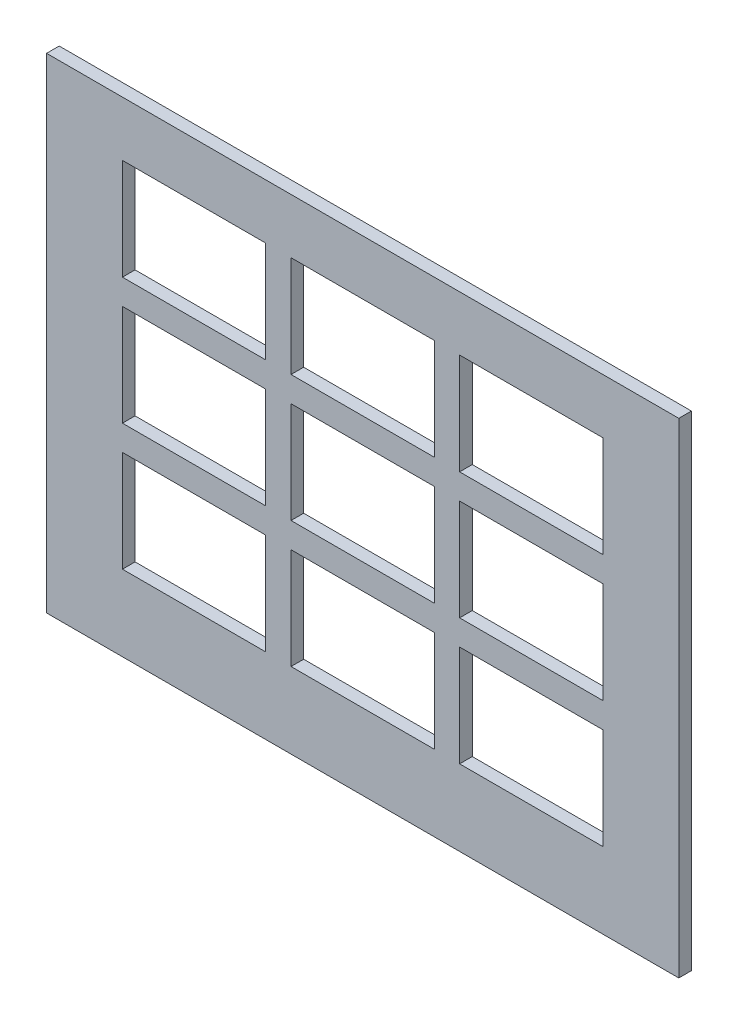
from build123d import *

# Parameters (mm, degrees)
ESQUISSE1_W      = 150
ESQUISSE1_H      = 115
ESQUISSE1_W_2    = 34
ESQUISSE1_H_2    = 24
EXTRUSION1_DEPTH = 3


with BuildPart() as part:
    # Esquisse1 → Extrusion1 (new body)
    with BuildSketch(Plane.XY):
        with Locations((75, 57.5)):
            Rectangle(ESQUISSE1_W, ESQUISSE1_H)
        with Locations((115, 60)):
            Rectangle(ESQUISSE1_W_2, ESQUISSE1_H_2, mode=Mode.SUBTRACT)
        with Locations((115, 90)):
            Rectangle(ESQUISSE1_W_2, ESQUISSE1_H_2, mode=Mode.SUBTRACT)
        with Locations((115, 30)):
            Rectangle(ESQUISSE1_W_2, ESQUISSE1_H_2, mode=Mode.SUBTRACT)
        with Locations((75, 30)):
            Rectangle(ESQUISSE1_W_2, ESQUISSE1_H_2, mode=Mode.SUBTRACT)
        with Locations((75, 60)):
            Rectangle(ESQUISSE1_W_2, ESQUISSE1_H_2, mode=Mode.SUBTRACT)
        with Locations((75, 90)):
            Rectangle(ESQUISSE1_W_2, ESQUISSE1_H_2, mode=Mode.SUBTRACT)
        with Locations((35, 30)):
            Rectangle(ESQUISSE1_W_2, ESQUISSE1_H_2, mode=Mode.SUBTRACT)
        with Locations((35, 60)):
            Rectangle(ESQUISSE1_W_2, ESQUISSE1_H_2, mode=Mode.SUBTRACT)
        with Locations((35, 90)):
            Rectangle(ESQUISSE1_W_2, ESQUISSE1_H_2, mode=Mode.SUBTRACT)
    extrude(amount=EXTRUSION1_DEPTH)


solid = part.part
